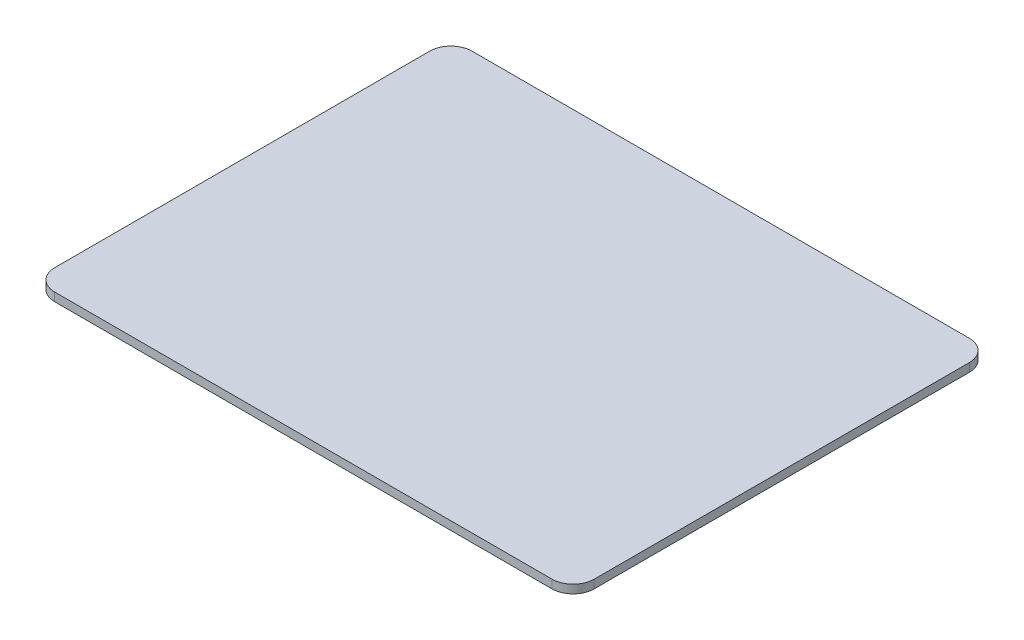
from build123d import *

# Parameters (mm, degrees)
ESQUISSE1_W        = 64
ESQUISSE1_H        = 49.5
BOSS_EXTRU_1_DEPTH = 1
CONG_1_R           = 2.5


with BuildPart() as part:
    # Esquisse1 → Boss.-Extru.1 (new body)
    with BuildSketch(Plane(origin=(0, 0, 0), x_dir=(1, 0, 0), z_dir=(0, 1, 0))):
        with Locations((32, 24.75)):
            Rectangle(ESQUISSE1_W, ESQUISSE1_H)
    extrude(amount=BOSS_EXTRU_1_DEPTH)

    # Cong_1
    cong_1_edges = [part.edges().sort_by_distance(p)[0] for p in [
        (0, 0.5, -49.5),
        (64, 0.5, -49.5),
        (64, 0.5, 0),
        (0, 0.5, 0),
    ]]
    fillet(cong_1_edges, radius=CONG_1_R)


solid = part.part
